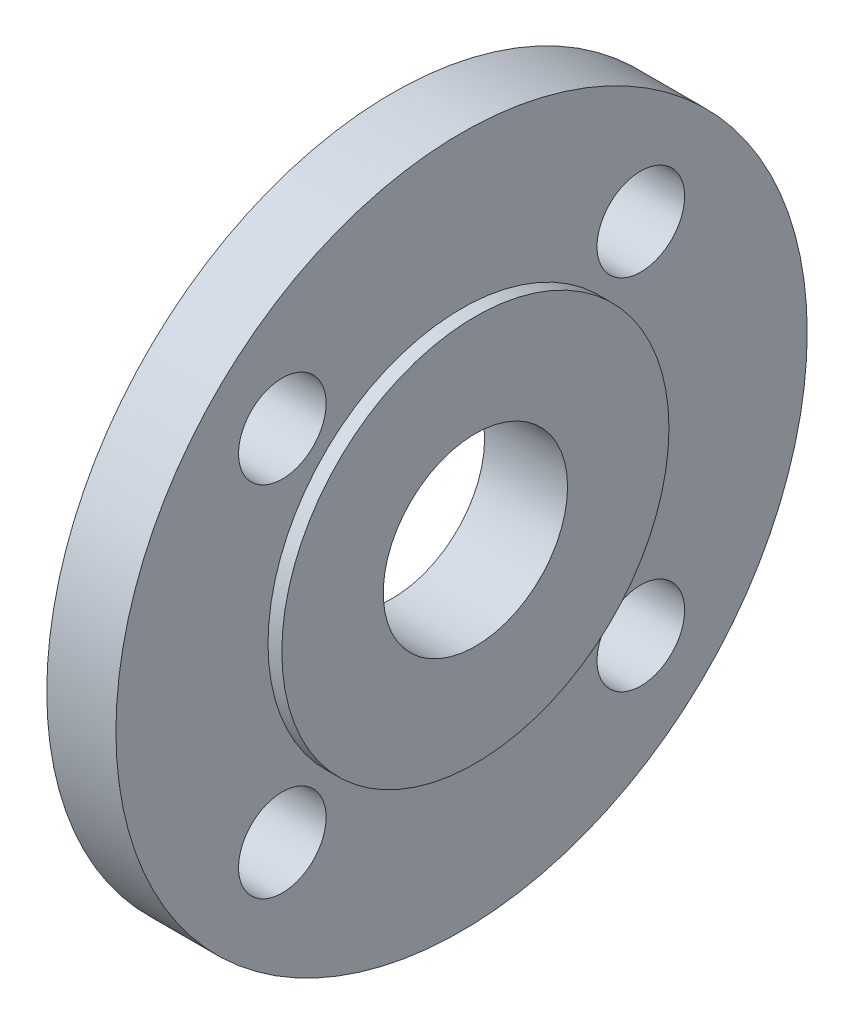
ISO-10303-21;
HEADER;
FILE_DESCRIPTION(('STEP AP214'),'2;1');
FILE_NAME('part.step','',(''),(''),'','','');
FILE_SCHEMA(('AUTOMOTIVE_DESIGN { 1 0 10303 214 1 1 1 1 }'));
ENDSEC;
DATA;
#1=APPLICATION_CONTEXT('core data for automotive mechanical design processes');
#2=APPLICATION_PROTOCOL_DEFINITION('international standard','automotive_design',2000,#1);
#3=PRODUCT_CONTEXT('',#1,'mechanical');
#4=PRODUCT('Part','Part','',(#3));
#5=PRODUCT_RELATED_PRODUCT_CATEGORY('part','',(#4));
#6=PRODUCT_DEFINITION_FORMATION('','',#4);
#7=PRODUCT_DEFINITION_CONTEXT('part definition',#1,'design');
#8=PRODUCT_DEFINITION('design','',#6,#7);
#9=PRODUCT_DEFINITION_SHAPE('','',#8);
#10=(LENGTH_UNIT() NAMED_UNIT(*) SI_UNIT(.MILLI.,.METRE.));
#11=(NAMED_UNIT(*) PLANE_ANGLE_UNIT() SI_UNIT($,.RADIAN.));
#12=(NAMED_UNIT(*) SI_UNIT($,.STERADIAN.) SOLID_ANGLE_UNIT());
#13=UNCERTAINTY_MEASURE_WITH_UNIT(LENGTH_MEASURE(1.E-05),#10,'distance_accuracy_value','');
#14=(GEOMETRIC_REPRESENTATION_CONTEXT(3) GLOBAL_UNCERTAINTY_ASSIGNED_CONTEXT((#13)) GLOBAL_UNIT_ASSIGNED_CONTEXT((#10,
#11,#12)) REPRESENTATION_CONTEXT('',''));
#15=CARTESIAN_POINT('',(0.,0.,0.));
#16=DIRECTION('',(0.,0.,1.));
#17=DIRECTION('',(1.,0.,0.));
#18=AXIS2_PLACEMENT_3D('',#15,#16,#17);
#19=CARTESIAN_POINT('',(0.,0.,0.));
#20=DIRECTION('',(1.,0.,0.));
#21=DIRECTION('',(0.,0.,-1.));
#22=AXIS2_PLACEMENT_3D('',#19,#20,#21);
#23=CYLINDRICAL_SURFACE('',#22,42.);
#24=CARTESIAN_POINT('',(18.,0.,0.));
#25=DIRECTION('',(1.,0.,0.));
#26=DIRECTION('',(0.,0.,-1.));
#27=AXIS2_PLACEMENT_3D('',#24,#25,#26);
#28=CIRCLE('',#27,42.);
#29=CARTESIAN_POINT('',(18.,0.,-42.));
#30=VERTEX_POINT('',#29);
#31=EDGE_CURVE('E58',#30,#30,#28,.T.);
#32=ORIENTED_EDGE('',*,*,#31,.F.);
#33=EDGE_LOOP('',(#32));
#34=FACE_BOUND('',#33,.T.);
#35=CARTESIAN_POINT('',(15.,0.,0.));
#36=DIRECTION('',(1.,0.,0.));
#37=DIRECTION('',(0.,0.,-1.));
#38=AXIS2_PLACEMENT_3D('',#35,#36,#37);
#39=CIRCLE('',#38,42.);
#40=CARTESIAN_POINT('',(15.,0.,-42.));
#41=VERTEX_POINT('',#40);
#42=EDGE_CURVE('E18',#41,#41,#39,.F.);
#43=ORIENTED_EDGE('',*,*,#42,.F.);
#44=EDGE_LOOP('',(#43));
#45=FACE_BOUND('',#44,.T.);
#46=ADVANCED_FACE('F15',(#34,#45),#23,.T.);
#47=CARTESIAN_POINT('',(15.,0.,0.));
#48=DIRECTION('',(1.,0.,0.));
#49=DIRECTION('',(0.,0.,-1.));
#50=AXIS2_PLACEMENT_3D('',#47,#48,#49);
#51=PLANE('',#50);
#52=ORIENTED_EDGE('',*,*,#42,.T.);
#53=EDGE_LOOP('',(#52));
#54=FACE_BOUND('',#53,.T.);
#55=CARTESIAN_POINT('',(15.,-38.89087296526,38.89087296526));
#56=DIRECTION('',(1.,0.,0.));
#57=DIRECTION('',(0.,0.,-1.));
#58=AXIS2_PLACEMENT_3D('',#55,#56,#57);
#59=CIRCLE('',#58,9.5);
#60=CARTESIAN_POINT('',(15.,-38.89087296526,29.39087296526));
#61=VERTEX_POINT('',#60);
#62=EDGE_CURVE('E44',#61,#61,#59,.F.);
#63=ORIENTED_EDGE('',*,*,#62,.T.);
#64=EDGE_LOOP('',(#63));
#65=FACE_BOUND('',#64,.T.);
#66=CARTESIAN_POINT('',(15.,38.89087296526,38.89087296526));
#67=DIRECTION('',(1.,0.,0.));
#68=DIRECTION('',(0.,0.,-1.));
#69=AXIS2_PLACEMENT_3D('',#66,#67,#68);
#70=CIRCLE('',#69,9.5);
#71=CARTESIAN_POINT('',(15.,38.89087296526,29.39087296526));
#72=VERTEX_POINT('',#71);
#73=EDGE_CURVE('E47',#72,#72,#70,.F.);
#74=ORIENTED_EDGE('',*,*,#73,.T.);
#75=EDGE_LOOP('',(#74));
#76=FACE_BOUND('',#75,.T.);
#77=CARTESIAN_POINT('',(15.,-38.89087296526,-38.89087296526));
#78=DIRECTION('',(1.,0.,0.));
#79=DIRECTION('',(0.,0.,-1.));
#80=AXIS2_PLACEMENT_3D('',#77,#78,#79);
#81=CIRCLE('',#80,9.5);
#82=CARTESIAN_POINT('',(15.,-38.89087296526,-48.39087296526));
#83=VERTEX_POINT('',#82);
#84=EDGE_CURVE('E50',#83,#83,#81,.F.);
#85=ORIENTED_EDGE('',*,*,#84,.T.);
#86=EDGE_LOOP('',(#85));
#87=FACE_BOUND('',#86,.T.);
#88=CARTESIAN_POINT('',(15.,38.89087296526,-38.89087296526));
#89=DIRECTION('',(1.,0.,0.));
#90=DIRECTION('',(0.,0.,-1.));
#91=AXIS2_PLACEMENT_3D('',#88,#89,#90);
#92=CIRCLE('',#91,9.5);
#93=CARTESIAN_POINT('',(15.,38.89087296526,-48.39087296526));
#94=VERTEX_POINT('',#93);
#95=EDGE_CURVE('E53',#94,#94,#92,.F.);
#96=ORIENTED_EDGE('',*,*,#95,.T.);
#97=EDGE_LOOP('',(#96));
#98=FACE_BOUND('',#97,.T.);
#99=CARTESIAN_POINT('',(15.,0.,0.));
#100=DIRECTION('',(1.,0.,0.));
#101=DIRECTION('',(0.,0.,-1.));
#102=AXIS2_PLACEMENT_3D('',#99,#100,#101);
#103=CIRCLE('',#102,75.);
#104=CARTESIAN_POINT('',(15.,0.,-75.));
#105=VERTEX_POINT('',#104);
#106=EDGE_CURVE('E56',#105,#105,#103,.F.);
#107=ORIENTED_EDGE('',*,*,#106,.F.);
#108=EDGE_LOOP('',(#107));
#109=FACE_BOUND('',#108,.T.);
#110=ADVANCED_FACE('F65',(#54,#65,#76,#87,#98,#109),#51,.T.);
#111=CARTESIAN_POINT('',(18.,0.,0.));
#112=DIRECTION('',(1.,0.,0.));
#113=DIRECTION('',(0.,0.,-1.));
#114=AXIS2_PLACEMENT_3D('',#111,#112,#113);
#115=PLANE('',#114);
#116=CARTESIAN_POINT('',(18.,0.,0.));
#117=DIRECTION('',(1.,0.,0.));
#118=DIRECTION('',(0.,0.,-1.));
#119=AXIS2_PLACEMENT_3D('',#116,#117,#118);
#120=CIRCLE('',#119,20.);
#121=CARTESIAN_POINT('',(18.,0.,-20.));
#122=VERTEX_POINT('',#121);
#123=EDGE_CURVE('E41',#122,#122,#120,.F.);
#124=ORIENTED_EDGE('',*,*,#123,.T.);
#125=EDGE_LOOP('',(#124));
#126=FACE_BOUND('',#125,.T.);
#127=ORIENTED_EDGE('',*,*,#31,.T.);
#128=EDGE_LOOP('',(#127));
#129=FACE_BOUND('',#128,.T.);
#130=ADVANCED_FACE('F74',(#126,#129),#115,.T.);
#131=CARTESIAN_POINT('',(0.,0.,0.));
#132=DIRECTION('',(1.,0.,0.));
#133=DIRECTION('',(0.,0.,-1.));
#134=AXIS2_PLACEMENT_3D('',#131,#132,#133);
#135=CYLINDRICAL_SURFACE('',#134,75.);
#136=ORIENTED_EDGE('',*,*,#106,.T.);
#137=EDGE_LOOP('',(#136));
#138=FACE_BOUND('',#137,.T.);
#139=CARTESIAN_POINT('',(0.,0.,0.));
#140=DIRECTION('',(1.,0.,0.));
#141=DIRECTION('',(0.,0.,-1.));
#142=AXIS2_PLACEMENT_3D('',#139,#140,#141);
#143=CIRCLE('',#142,75.);
#144=CARTESIAN_POINT('',(0.,0.,-75.));
#145=VERTEX_POINT('',#144);
#146=EDGE_CURVE('E38',#145,#145,#143,.T.);
#147=ORIENTED_EDGE('',*,*,#146,.T.);
#148=EDGE_LOOP('',(#147));
#149=FACE_BOUND('',#148,.T.);
#150=ADVANCED_FACE('F102',(#138,#149),#135,.T.);
#151=CARTESIAN_POINT('',(0.,38.89087296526,-38.89087296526));
#152=DIRECTION('',(1.,0.,0.));
#153=DIRECTION('',(0.,0.,-1.));
#154=AXIS2_PLACEMENT_3D('',#151,#152,#153);
#155=CYLINDRICAL_SURFACE('',#154,9.5);
#156=ORIENTED_EDGE('',*,*,#95,.F.);
#157=EDGE_LOOP('',(#156));
#158=FACE_BOUND('',#157,.T.);
#159=CARTESIAN_POINT('',(0.,38.89087296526,-38.89087296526));
#160=DIRECTION('',(1.,0.,0.));
#161=DIRECTION('',(0.,0.,-1.));
#162=AXIS2_PLACEMENT_3D('',#159,#160,#161);
#163=CIRCLE('',#162,9.5);
#164=CARTESIAN_POINT('',(0.,38.89087296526,-48.39087296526));
#165=VERTEX_POINT('',#164);
#166=EDGE_CURVE('E35',#165,#165,#163,.F.);
#167=ORIENTED_EDGE('',*,*,#166,.T.);
#168=EDGE_LOOP('',(#167));
#169=FACE_BOUND('',#168,.T.);
#170=ADVANCED_FACE('F98',(#158,#169),#155,.F.);
#171=CARTESIAN_POINT('',(0.,-38.89087296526,-38.89087296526));
#172=DIRECTION('',(1.,0.,0.));
#173=DIRECTION('',(0.,0.,-1.));
#174=AXIS2_PLACEMENT_3D('',#171,#172,#173);
#175=CYLINDRICAL_SURFACE('',#174,9.5);
#176=ORIENTED_EDGE('',*,*,#84,.F.);
#177=EDGE_LOOP('',(#176));
#178=FACE_BOUND('',#177,.T.);
#179=CARTESIAN_POINT('',(0.,-38.89087296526,-38.89087296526));
#180=DIRECTION('',(1.,0.,0.));
#181=DIRECTION('',(0.,0.,-1.));
#182=AXIS2_PLACEMENT_3D('',#179,#180,#181);
#183=CIRCLE('',#182,9.5);
#184=CARTESIAN_POINT('',(0.,-38.89087296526,-48.39087296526));
#185=VERTEX_POINT('',#184);
#186=EDGE_CURVE('E32',#185,#185,#183,.F.);
#187=ORIENTED_EDGE('',*,*,#186,.T.);
#188=EDGE_LOOP('',(#187));
#189=FACE_BOUND('',#188,.T.);
#190=ADVANCED_FACE('F94',(#178,#189),#175,.F.);
#191=CARTESIAN_POINT('',(0.,38.89087296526,38.89087296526));
#192=DIRECTION('',(1.,0.,0.));
#193=DIRECTION('',(0.,0.,-1.));
#194=AXIS2_PLACEMENT_3D('',#191,#192,#193);
#195=CYLINDRICAL_SURFACE('',#194,9.5);
#196=ORIENTED_EDGE('',*,*,#73,.F.);
#197=EDGE_LOOP('',(#196));
#198=FACE_BOUND('',#197,.T.);
#199=CARTESIAN_POINT('',(0.,38.89087296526,38.89087296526));
#200=DIRECTION('',(1.,0.,0.));
#201=DIRECTION('',(0.,0.,-1.));
#202=AXIS2_PLACEMENT_3D('',#199,#200,#201);
#203=CIRCLE('',#202,9.5);
#204=CARTESIAN_POINT('',(0.,38.89087296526,29.39087296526));
#205=VERTEX_POINT('',#204);
#206=EDGE_CURVE('E27',#205,#205,#203,.F.);
#207=ORIENTED_EDGE('',*,*,#206,.T.);
#208=EDGE_LOOP('',(#207));
#209=FACE_BOUND('',#208,.T.);
#210=ADVANCED_FACE('F90',(#198,#209),#195,.F.);
#211=CARTESIAN_POINT('',(0.,-38.89087296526,38.89087296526));
#212=DIRECTION('',(1.,0.,0.));
#213=DIRECTION('',(0.,0.,-1.));
#214=AXIS2_PLACEMENT_3D('',#211,#212,#213);
#215=CYLINDRICAL_SURFACE('',#214,9.5);
#216=ORIENTED_EDGE('',*,*,#62,.F.);
#217=EDGE_LOOP('',(#216));
#218=FACE_BOUND('',#217,.T.);
#219=CARTESIAN_POINT('',(0.,-38.89087296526,38.89087296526));
#220=DIRECTION('',(1.,0.,0.));
#221=DIRECTION('',(0.,0.,-1.));
#222=AXIS2_PLACEMENT_3D('',#219,#220,#221);
#223=CIRCLE('',#222,9.5);
#224=CARTESIAN_POINT('',(0.,-38.89087296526,29.39087296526));
#225=VERTEX_POINT('',#224);
#226=EDGE_CURVE('E22',#225,#225,#223,.F.);
#227=ORIENTED_EDGE('',*,*,#226,.T.);
#228=EDGE_LOOP('',(#227));
#229=FACE_BOUND('',#228,.T.);
#230=ADVANCED_FACE('F83',(#218,#229),#215,.F.);
#231=CARTESIAN_POINT('',(0.,0.,0.));
#232=DIRECTION('',(1.,0.,0.));
#233=DIRECTION('',(0.,0.,-1.));
#234=AXIS2_PLACEMENT_3D('',#231,#232,#233);
#235=CYLINDRICAL_SURFACE('',#234,20.);
#236=ORIENTED_EDGE('',*,*,#123,.F.);
#237=EDGE_LOOP('',(#236));
#238=FACE_BOUND('',#237,.T.);
#239=CARTESIAN_POINT('',(0.,0.,0.));
#240=DIRECTION('',(1.,0.,0.));
#241=DIRECTION('',(0.,0.,-1.));
#242=AXIS2_PLACEMENT_3D('',#239,#240,#241);
#243=CIRCLE('',#242,20.);
#244=CARTESIAN_POINT('',(0.,0.,-20.));
#245=VERTEX_POINT('',#244);
#246=EDGE_CURVE('E10',#245,#245,#243,.F.);
#247=ORIENTED_EDGE('',*,*,#246,.T.);
#248=EDGE_LOOP('',(#247));
#249=FACE_BOUND('',#248,.T.);
#250=ADVANCED_FACE('F77',(#238,#249),#235,.F.);
#251=CARTESIAN_POINT('',(0.,0.,0.));
#252=DIRECTION('',(1.,0.,0.));
#253=DIRECTION('',(0.,0.,-1.));
#254=AXIS2_PLACEMENT_3D('',#251,#252,#253);
#255=PLANE('',#254);
#256=ORIENTED_EDGE('',*,*,#246,.F.);
#257=EDGE_LOOP('',(#256));
#258=FACE_BOUND('',#257,.T.);
#259=ORIENTED_EDGE('',*,*,#226,.F.);
#260=EDGE_LOOP('',(#259));
#261=FACE_BOUND('',#260,.T.);
#262=ORIENTED_EDGE('',*,*,#206,.F.);
#263=EDGE_LOOP('',(#262));
#264=FACE_BOUND('',#263,.T.);
#265=ORIENTED_EDGE('',*,*,#186,.F.);
#266=EDGE_LOOP('',(#265));
#267=FACE_BOUND('',#266,.T.);
#268=ORIENTED_EDGE('',*,*,#166,.F.);
#269=EDGE_LOOP('',(#268));
#270=FACE_BOUND('',#269,.T.);
#271=ORIENTED_EDGE('',*,*,#146,.F.);
#272=EDGE_LOOP('',(#271));
#273=FACE_BOUND('',#272,.T.);
#274=ADVANCED_FACE('F75',(#258,#261,#264,#267,#270,#273),#255,.F.);
#275=CLOSED_SHELL('',(#46,#110,#130,#150,#170,#190,#210,#230,#250,#274));
#276=MANIFOLD_SOLID_BREP('B1',#275);
#277=ADVANCED_BREP_SHAPE_REPRESENTATION('',(#18,#276),#14);
#278=SHAPE_DEFINITION_REPRESENTATION(#9,#277);
ENDSEC;
END-ISO-10303-21;
